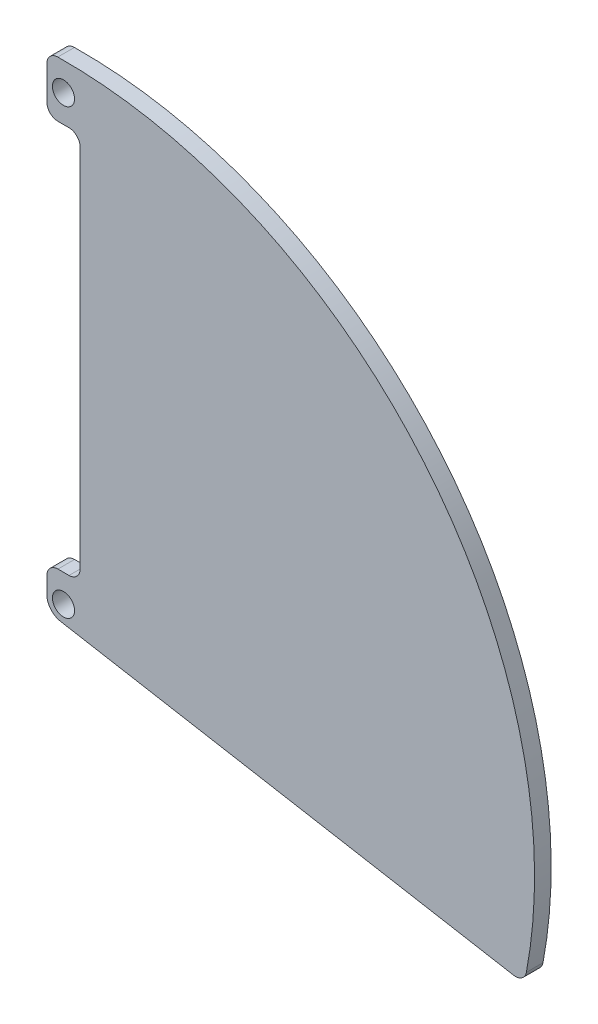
from build123d import *

# Parameters (mm, degrees)
SKETCH1_R           = 10
BOSS_EXTRUDE1_DEPTH = 15
CUT_EXTRUDE1_DEPTH  = 602.602027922
FILLET1_R           = 10


with BuildPart() as part:
    # Sketch1 → Boss-Extrude1 (new body)
    with BuildSketch(Plane.XY):
        with BuildLine():
            ThreePointArc((-15, 425), (325.771601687, 273.354830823), (415.938572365, -88.572591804))
            Line((415.938572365, -88.572591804), (-2.604722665, -14.772116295))
            ThreePointArc((-2.604722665, -14.772116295), (-11.490666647, -9.641814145), (-15, 0))
            Line((-15, 0), (-15, 425))
        make_face()
        Circle(SKETCH1_R, mode=Mode.SUBTRACT)
        with Locations((0, 400)):
            Circle(SKETCH1_R, mode=Mode.SUBTRACT)
    extrude(amount=BOSS_EXTRUDE1_DEPTH)

    # Sketch2 → Cut-Extrude1 (cut, through all)
    with BuildSketch(Plane.XY):
        Polygon((-15, 425), (-15, 375), (15, 375), (15, 25), (-15, 25), (-131.566651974, 425), align=None)
    extrude(amount=CUT_EXTRUDE1_DEPTH, mode=Mode.SUBTRACT)

    # Fillet1
    fillet1_edges = [part.edges().sort_by_distance(p)[0] for p in [
        (415.938572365, -88.572591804, 7.5),
        (-15, 425, 7.5),
        (-15, 25, 7.5),
        (15, 25, 7.5),
        (15, 375, 7.5),
        (-15, 375, 7.5),
    ]]
    fillet(fillet1_edges, radius=FILLET1_R)


solid = part.part
